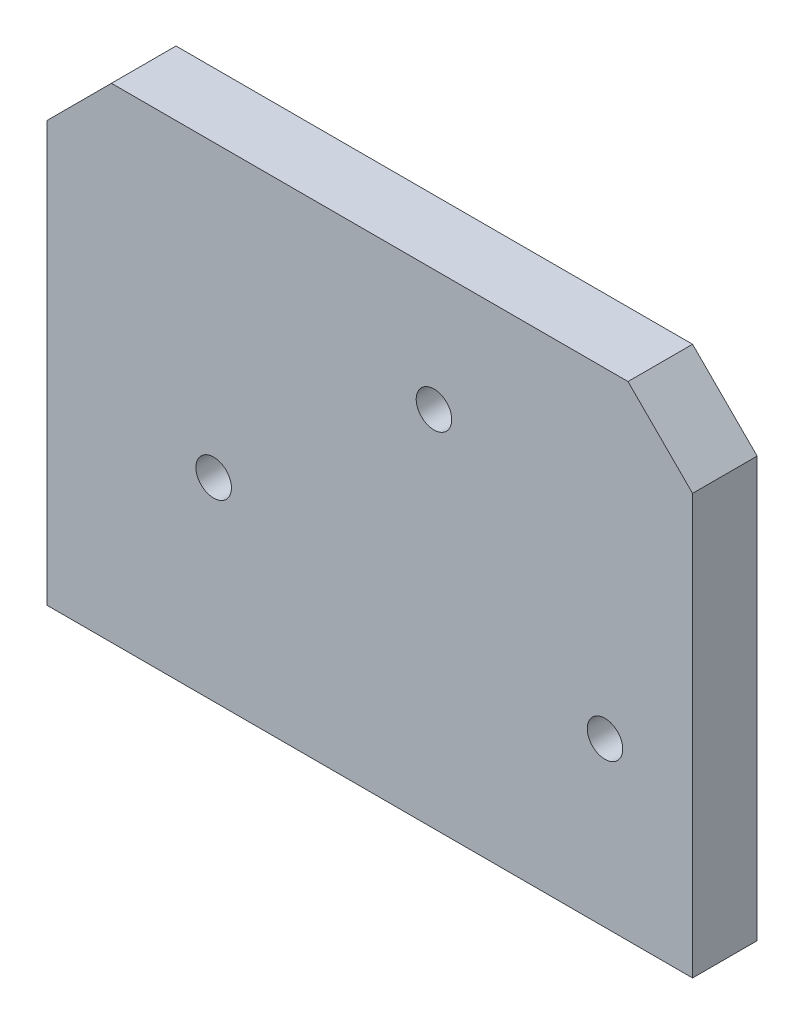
ISO-10303-21;
HEADER;
FILE_DESCRIPTION(('STEP AP214'),'2;1');
FILE_NAME('part.step','',(''),(''),'','','');
FILE_SCHEMA(('AUTOMOTIVE_DESIGN { 1 0 10303 214 1 1 1 1 }'));
ENDSEC;
DATA;
#1=APPLICATION_CONTEXT('core data for automotive mechanical design processes');
#2=APPLICATION_PROTOCOL_DEFINITION('international standard','automotive_design',2000,#1);
#3=PRODUCT_CONTEXT('',#1,'mechanical');
#4=PRODUCT('Part','Part','',(#3));
#5=PRODUCT_RELATED_PRODUCT_CATEGORY('part','',(#4));
#6=PRODUCT_DEFINITION_FORMATION('','',#4);
#7=PRODUCT_DEFINITION_CONTEXT('part definition',#1,'design');
#8=PRODUCT_DEFINITION('design','',#6,#7);
#9=PRODUCT_DEFINITION_SHAPE('','',#8);
#10=(LENGTH_UNIT() NAMED_UNIT(*) SI_UNIT(.MILLI.,.METRE.));
#11=(NAMED_UNIT(*) PLANE_ANGLE_UNIT() SI_UNIT($,.RADIAN.));
#12=(NAMED_UNIT(*) SI_UNIT($,.STERADIAN.) SOLID_ANGLE_UNIT());
#13=UNCERTAINTY_MEASURE_WITH_UNIT(LENGTH_MEASURE(1.E-05),#10,'distance_accuracy_value','');
#14=(GEOMETRIC_REPRESENTATION_CONTEXT(3) GLOBAL_UNCERTAINTY_ASSIGNED_CONTEXT((#13)) GLOBAL_UNIT_ASSIGNED_CONTEXT((#10,
#11,#12)) REPRESENTATION_CONTEXT('',''));
#15=CARTESIAN_POINT('',(0.,0.,0.));
#16=DIRECTION('',(0.,0.,1.));
#17=DIRECTION('',(1.,0.,0.));
#18=AXIS2_PLACEMENT_3D('',#15,#16,#17);
#19=CARTESIAN_POINT('',(-100.,75.,20.));
#20=DIRECTION('',(1.,0.,0.));
#21=DIRECTION('',(0.,1.,0.));
#22=AXIS2_PLACEMENT_3D('',#19,#20,#21);
#23=PLANE('',#22);
#24=DIRECTION('',(0.,-1.,0.));
#25=VECTOR('',#24,1.);
#26=CARTESIAN_POINT('',(-100.,75.,20.));
#27=LINE('',#26,#25);
#28=CARTESIAN_POINT('',(-100.,55.,20.));
#29=VERTEX_POINT('',#28);
#30=CARTESIAN_POINT('',(-100.,-75.,20.));
#31=VERTEX_POINT('',#30);
#32=EDGE_CURVE('E126',#29,#31,#27,.T.);
#33=ORIENTED_EDGE('',*,*,#32,.F.);
#34=DIRECTION('',(0.,0.,-1.));
#35=VECTOR('',#34,1.);
#36=CARTESIAN_POINT('',(-100.,55.,20.));
#37=LINE('',#36,#35);
#38=CARTESIAN_POINT('',(-100.,55.,0.));
#39=VERTEX_POINT('',#38);
#40=EDGE_CURVE('E92',#29,#39,#37,.T.);
#41=ORIENTED_EDGE('',*,*,#40,.T.);
#42=DIRECTION('',(0.,-1.,0.));
#43=VECTOR('',#42,1.);
#44=CARTESIAN_POINT('',(-100.,75.,0.));
#45=LINE('',#44,#43);
#46=CARTESIAN_POINT('',(-100.,-75.,0.));
#47=VERTEX_POINT('',#46);
#48=EDGE_CURVE('E86',#39,#47,#45,.T.);
#49=ORIENTED_EDGE('',*,*,#48,.T.);
#50=DIRECTION('',(0.,0.,-1.));
#51=VECTOR('',#50,1.);
#52=CARTESIAN_POINT('',(-100.,-75.,20.));
#53=LINE('',#52,#51);
#54=EDGE_CURVE('E90',#31,#47,#53,.T.);
#55=ORIENTED_EDGE('',*,*,#54,.F.);
#56=EDGE_LOOP('',(#33,#41,#49,#55));
#57=FACE_BOUND('',#56,.T.);
#58=ADVANCED_FACE('F31',(#57),#23,.F.);
#59=CARTESIAN_POINT('',(-100.,-75.,20.));
#60=DIRECTION('',(0.,1.,0.));
#61=DIRECTION('',(0.,0.,1.));
#62=AXIS2_PLACEMENT_3D('',#59,#60,#61);
#63=PLANE('',#62);
#64=DIRECTION('',(1.,0.,0.));
#65=VECTOR('',#64,1.);
#66=CARTESIAN_POINT('',(-100.,-75.,0.));
#67=LINE('',#66,#65);
#68=CARTESIAN_POINT('',(100.,-75.,0.));
#69=VERTEX_POINT('',#68);
#70=EDGE_CURVE('E94',#47,#69,#67,.T.);
#71=ORIENTED_EDGE('',*,*,#70,.T.);
#72=DIRECTION('',(0.,0.,-1.));
#73=VECTOR('',#72,1.);
#74=CARTESIAN_POINT('',(100.,-75.,20.));
#75=LINE('',#74,#73);
#76=CARTESIAN_POINT('',(100.,-75.,20.));
#77=VERTEX_POINT('',#76);
#78=EDGE_CURVE('E107',#77,#69,#75,.T.);
#79=ORIENTED_EDGE('',*,*,#78,.F.);
#80=DIRECTION('',(1.,0.,0.));
#81=VECTOR('',#80,1.);
#82=CARTESIAN_POINT('',(-100.,-75.,20.));
#83=LINE('',#82,#81);
#84=EDGE_CURVE('E106',#31,#77,#83,.T.);
#85=ORIENTED_EDGE('',*,*,#84,.F.);
#86=ORIENTED_EDGE('',*,*,#54,.T.);
#87=EDGE_LOOP('',(#71,#79,#85,#86));
#88=FACE_BOUND('',#87,.T.);
#89=ADVANCED_FACE('F105',(#88),#63,.F.);
#90=CARTESIAN_POINT('',(100.,75.,20.));
#91=DIRECTION('',(-1.,0.,0.));
#92=DIRECTION('',(0.,-1.,0.));
#93=AXIS2_PLACEMENT_3D('',#90,#91,#92);
#94=PLANE('',#93);
#95=DIRECTION('',(0.,1.,0.));
#96=VECTOR('',#95,1.);
#97=CARTESIAN_POINT('',(100.,75.,0.));
#98=LINE('',#97,#96);
#99=CARTESIAN_POINT('',(100.,54.9999999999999,0.));
#100=VERTEX_POINT('',#99);
#101=EDGE_CURVE('E99',#69,#100,#98,.T.);
#102=ORIENTED_EDGE('',*,*,#101,.T.);
#103=DIRECTION('',(0.,0.,1.));
#104=VECTOR('',#103,1.);
#105=CARTESIAN_POINT('',(100.,54.9999999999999,20.));
#106=LINE('',#105,#104);
#107=CARTESIAN_POINT('',(100.,55.,20.));
#108=VERTEX_POINT('',#107);
#109=EDGE_CURVE('E11',#100,#108,#106,.T.);
#110=ORIENTED_EDGE('',*,*,#109,.T.);
#111=DIRECTION('',(0.,1.,0.));
#112=VECTOR('',#111,1.);
#113=CARTESIAN_POINT('',(100.,75.,20.));
#114=LINE('',#113,#112);
#115=EDGE_CURVE('E138',#77,#108,#114,.T.);
#116=ORIENTED_EDGE('',*,*,#115,.F.);
#117=ORIENTED_EDGE('',*,*,#78,.T.);
#118=EDGE_LOOP('',(#102,#110,#116,#117));
#119=FACE_BOUND('',#118,.T.);
#120=ADVANCED_FACE('F142',(#119),#94,.F.);
#121=CARTESIAN_POINT('',(-100.,75.,20.));
#122=DIRECTION('',(0.,-1.,0.));
#123=DIRECTION('',(0.,0.,-1.));
#124=AXIS2_PLACEMENT_3D('',#121,#122,#123);
#125=PLANE('',#124);
#126=DIRECTION('',(-1.,0.,0.));
#127=VECTOR('',#126,1.);
#128=CARTESIAN_POINT('',(-100.,75.,0.));
#129=LINE('',#128,#127);
#130=CARTESIAN_POINT('',(80.,75.,0.));
#131=VERTEX_POINT('',#130);
#132=CARTESIAN_POINT('',(-80.,75.,0.));
#133=VERTEX_POINT('',#132);
#134=EDGE_CURVE('E128',#131,#133,#129,.T.);
#135=ORIENTED_EDGE('',*,*,#134,.T.);
#136=DIRECTION('',(0.,0.,1.));
#137=VECTOR('',#136,1.);
#138=CARTESIAN_POINT('',(-80.,75.,20.));
#139=LINE('',#138,#137);
#140=CARTESIAN_POINT('',(-80.,75.,20.));
#141=VERTEX_POINT('',#140);
#142=EDGE_CURVE('E51',#133,#141,#139,.T.);
#143=ORIENTED_EDGE('',*,*,#142,.T.);
#144=DIRECTION('',(-1.,0.,0.));
#145=VECTOR('',#144,1.);
#146=CARTESIAN_POINT('',(-100.,75.,20.));
#147=LINE('',#146,#145);
#148=CARTESIAN_POINT('',(80.0000000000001,75.,20.));
#149=VERTEX_POINT('',#148);
#150=EDGE_CURVE('E111',#149,#141,#147,.T.);
#151=ORIENTED_EDGE('',*,*,#150,.F.);
#152=DIRECTION('',(0.,0.,-1.));
#153=VECTOR('',#152,1.);
#154=CARTESIAN_POINT('',(80.,75.,20.));
#155=LINE('',#154,#153);
#156=EDGE_CURVE('E118',#149,#131,#155,.T.);
#157=ORIENTED_EDGE('',*,*,#156,.T.);
#158=EDGE_LOOP('',(#135,#143,#151,#157));
#159=FACE_BOUND('',#158,.T.);
#160=ADVANCED_FACE('F132',(#159),#125,.F.);
#161=CARTESIAN_POINT('',(-100.,-75.,20.));
#162=DIRECTION('',(0.,0.,1.));
#163=DIRECTION('',(1.,0.,0.));
#164=AXIS2_PLACEMENT_3D('',#161,#162,#163);
#165=PLANE('',#164);
#166=CARTESIAN_POINT('',(-48.3307566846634,-14.9409518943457,20.));
#167=DIRECTION('',(0.,0.,1.));
#168=DIRECTION('',(1.,0.,0.));
#169=AXIS2_PLACEMENT_3D('',#166,#167,#168);
#170=CIRCLE('',#169,5.49999999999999);
#171=CARTESIAN_POINT('',(-42.8307566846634,-14.9409518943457,20.));
#172=VERTEX_POINT('',#171);
#173=EDGE_CURVE('E240',#172,#172,#170,.T.);
#174=ORIENTED_EDGE('',*,*,#173,.F.);
#175=EDGE_LOOP('',(#174));
#176=FACE_BOUND('',#175,.T.);
#177=CARTESIAN_POINT('',(19.9030275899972,37.4630529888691,20.));
#178=DIRECTION('',(0.,0.,1.));
#179=DIRECTION('',(1.,0.,0.));
#180=AXIS2_PLACEMENT_3D('',#177,#178,#179);
#181=CIRCLE('',#180,5.49999999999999);
#182=CARTESIAN_POINT('',(25.4030275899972,37.4630529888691,20.));
#183=VERTEX_POINT('',#182);
#184=EDGE_CURVE('E250',#183,#183,#181,.T.);
#185=ORIENTED_EDGE('',*,*,#184,.F.);
#186=EDGE_LOOP('',(#185));
#187=FACE_BOUND('',#186,.T.);
#188=CARTESIAN_POINT('',(72.8705824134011,-24.4007237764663,20.));
#189=DIRECTION('',(0.,0.,1.));
#190=DIRECTION('',(1.,0.,0.));
#191=AXIS2_PLACEMENT_3D('',#188,#189,#190);
#192=CIRCLE('',#191,5.49999999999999);
#193=CARTESIAN_POINT('',(78.370582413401,-24.4007237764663,20.));
#194=VERTEX_POINT('',#193);
#195=EDGE_CURVE('E95',#194,#194,#192,.T.);
#196=ORIENTED_EDGE('',*,*,#195,.F.);
#197=EDGE_LOOP('',(#196));
#198=FACE_BOUND('',#197,.T.);
#199=ORIENTED_EDGE('',*,*,#150,.T.);
#200=DIRECTION('',(0.707106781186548,0.707106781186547,0.));
#201=VECTOR('',#200,1.);
#202=CARTESIAN_POINT('',(-165.,-9.99999999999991,20.));
#203=LINE('',#202,#201);
#204=EDGE_CURVE('E38',#141,#29,#203,.F.);
#205=ORIENTED_EDGE('',*,*,#204,.T.);
#206=ORIENTED_EDGE('',*,*,#32,.T.);
#207=ORIENTED_EDGE('',*,*,#84,.T.);
#208=ORIENTED_EDGE('',*,*,#115,.T.);
#209=DIRECTION('',(0.707106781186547,-0.707106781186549,0.));
#210=VECTOR('',#209,1.);
#211=CARTESIAN_POINT('',(65.0000000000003,89.9999999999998,20.));
#212=LINE('',#211,#210);
#213=EDGE_CURVE('E122',#108,#149,#212,.F.);
#214=ORIENTED_EDGE('',*,*,#213,.T.);
#215=EDGE_LOOP('',(#199,#205,#206,#207,#208,#214));
#216=FACE_BOUND('',#215,.T.);
#217=ADVANCED_FACE('F125',(#176,#187,#198,#216),#165,.T.);
#218=CARTESIAN_POINT('',(-100.,-75.,0.));
#219=DIRECTION('',(0.,0.,1.));
#220=DIRECTION('',(1.,0.,0.));
#221=AXIS2_PLACEMENT_3D('',#218,#219,#220);
#222=PLANE('',#221);
#223=CARTESIAN_POINT('',(-48.3307566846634,-14.9409518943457,0.));
#224=DIRECTION('',(0.,0.,1.));
#225=DIRECTION('',(1.,0.,0.));
#226=AXIS2_PLACEMENT_3D('',#223,#224,#225);
#227=CIRCLE('',#226,5.49999999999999);
#228=CARTESIAN_POINT('',(-42.8307566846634,-14.9409518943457,0.));
#229=VERTEX_POINT('',#228);
#230=EDGE_CURVE('E243',#229,#229,#227,.T.);
#231=ORIENTED_EDGE('',*,*,#230,.T.);
#232=EDGE_LOOP('',(#231));
#233=FACE_BOUND('',#232,.T.);
#234=CARTESIAN_POINT('',(19.9030275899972,37.4630529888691,0.));
#235=DIRECTION('',(0.,0.,1.));
#236=DIRECTION('',(1.,0.,0.));
#237=AXIS2_PLACEMENT_3D('',#234,#235,#236);
#238=CIRCLE('',#237,5.49999999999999);
#239=CARTESIAN_POINT('',(25.4030275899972,37.4630529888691,0.));
#240=VERTEX_POINT('',#239);
#241=EDGE_CURVE('E245',#240,#240,#238,.T.);
#242=ORIENTED_EDGE('',*,*,#241,.T.);
#243=EDGE_LOOP('',(#242));
#244=FACE_BOUND('',#243,.T.);
#245=CARTESIAN_POINT('',(72.8705824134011,-24.4007237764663,0.));
#246=DIRECTION('',(0.,0.,1.));
#247=DIRECTION('',(1.,0.,0.));
#248=AXIS2_PLACEMENT_3D('',#245,#246,#247);
#249=CIRCLE('',#248,5.49999999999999);
#250=CARTESIAN_POINT('',(78.370582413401,-24.4007237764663,0.));
#251=VERTEX_POINT('',#250);
#252=EDGE_CURVE('E253',#251,#251,#249,.T.);
#253=ORIENTED_EDGE('',*,*,#252,.T.);
#254=EDGE_LOOP('',(#253));
#255=FACE_BOUND('',#254,.T.);
#256=ORIENTED_EDGE('',*,*,#48,.F.);
#257=DIRECTION('',(-0.707106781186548,-0.707106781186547,0.));
#258=VECTOR('',#257,1.);
#259=CARTESIAN_POINT('',(-100.,55.,0.));
#260=LINE('',#259,#258);
#261=EDGE_CURVE('E116',#39,#133,#260,.F.);
#262=ORIENTED_EDGE('',*,*,#261,.T.);
#263=ORIENTED_EDGE('',*,*,#134,.F.);
#264=DIRECTION('',(-0.707106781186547,0.707106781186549,0.));
#265=VECTOR('',#264,1.);
#266=CARTESIAN_POINT('',(80.,75.,0.));
#267=LINE('',#266,#265);
#268=EDGE_CURVE('E109',#131,#100,#267,.F.);
#269=ORIENTED_EDGE('',*,*,#268,.T.);
#270=ORIENTED_EDGE('',*,*,#101,.F.);
#271=ORIENTED_EDGE('',*,*,#70,.F.);
#272=EDGE_LOOP('',(#256,#262,#263,#269,#270,#271));
#273=FACE_BOUND('',#272,.T.);
#274=ADVANCED_FACE('F98',(#233,#244,#255,#273),#222,.F.);
#275=CARTESIAN_POINT('',(-100.,55.,20.));
#276=DIRECTION('',(0.707106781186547,-0.707106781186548,0.));
#277=DIRECTION('',(0.707106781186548,0.707106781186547,0.));
#278=AXIS2_PLACEMENT_3D('',#275,#276,#277);
#279=PLANE('',#278);
#280=ORIENTED_EDGE('',*,*,#204,.F.);
#281=ORIENTED_EDGE('',*,*,#142,.F.);
#282=ORIENTED_EDGE('',*,*,#261,.F.);
#283=ORIENTED_EDGE('',*,*,#40,.F.);
#284=EDGE_LOOP('',(#280,#281,#282,#283));
#285=FACE_BOUND('',#284,.T.);
#286=ADVANCED_FACE('F130',(#285),#279,.F.);
#287=CARTESIAN_POINT('',(80.,75.,20.));
#288=DIRECTION('',(-0.707106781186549,-0.707106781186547,0.));
#289=DIRECTION('',(0.707106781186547,-0.707106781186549,0.));
#290=AXIS2_PLACEMENT_3D('',#287,#288,#289);
#291=PLANE('',#290);
#292=ORIENTED_EDGE('',*,*,#213,.F.);
#293=ORIENTED_EDGE('',*,*,#109,.F.);
#294=ORIENTED_EDGE('',*,*,#268,.F.);
#295=ORIENTED_EDGE('',*,*,#156,.F.);
#296=EDGE_LOOP('',(#292,#293,#294,#295));
#297=FACE_BOUND('',#296,.T.);
#298=ADVANCED_FACE('F141',(#297),#291,.F.);
#299=CARTESIAN_POINT('',(72.8705824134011,-24.4007237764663,40.));
#300=DIRECTION('',(0.,0.,1.));
#301=DIRECTION('',(1.,0.,0.));
#302=AXIS2_PLACEMENT_3D('',#299,#300,#301);
#303=CYLINDRICAL_SURFACE('',#302,5.49999999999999);
#304=ORIENTED_EDGE('',*,*,#195,.T.);
#305=EDGE_LOOP('',(#304));
#306=FACE_BOUND('',#305,.T.);
#307=ORIENTED_EDGE('',*,*,#252,.F.);
#308=EDGE_LOOP('',(#307));
#309=FACE_BOUND('',#308,.T.);
#310=ADVANCED_FACE('F202',(#306,#309),#303,.F.);
#311=CARTESIAN_POINT('',(19.9030275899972,37.4630529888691,40.));
#312=DIRECTION('',(0.,0.,1.));
#313=DIRECTION('',(1.,0.,0.));
#314=AXIS2_PLACEMENT_3D('',#311,#312,#313);
#315=CYLINDRICAL_SURFACE('',#314,5.49999999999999);
#316=ORIENTED_EDGE('',*,*,#184,.T.);
#317=EDGE_LOOP('',(#316));
#318=FACE_BOUND('',#317,.T.);
#319=ORIENTED_EDGE('',*,*,#241,.F.);
#320=EDGE_LOOP('',(#319));
#321=FACE_BOUND('',#320,.T.);
#322=ADVANCED_FACE('F209',(#318,#321),#315,.F.);
#323=CARTESIAN_POINT('',(-48.3307566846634,-14.9409518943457,40.));
#324=DIRECTION('',(0.,0.,1.));
#325=DIRECTION('',(1.,0.,0.));
#326=AXIS2_PLACEMENT_3D('',#323,#324,#325);
#327=CYLINDRICAL_SURFACE('',#326,5.49999999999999);
#328=ORIENTED_EDGE('',*,*,#173,.T.);
#329=EDGE_LOOP('',(#328));
#330=FACE_BOUND('',#329,.T.);
#331=ORIENTED_EDGE('',*,*,#230,.F.);
#332=EDGE_LOOP('',(#331));
#333=FACE_BOUND('',#332,.T.);
#334=ADVANCED_FACE('F218',(#330,#333),#327,.F.);
#335=CLOSED_SHELL('',(#58,#89,#120,#160,#217,#274,#286,#298,#310,#322,#334));
#336=MANIFOLD_SOLID_BREP('B2',#335);
#337=ADVANCED_BREP_SHAPE_REPRESENTATION('',(#18,#336),#14);
#338=SHAPE_DEFINITION_REPRESENTATION(#9,#337);
ENDSEC;
END-ISO-10303-21;
